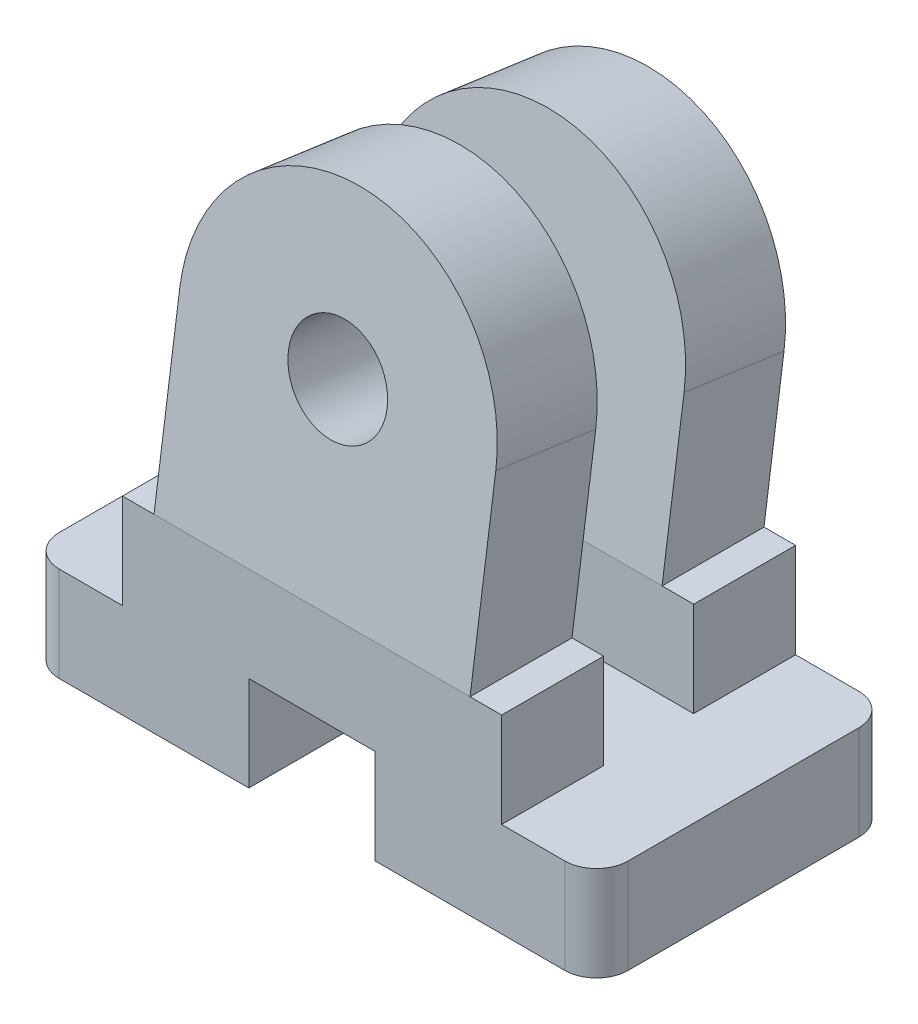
ISO-10303-21;
HEADER;
FILE_DESCRIPTION(('STEP AP214'),'2;1');
FILE_NAME('part.step','',(''),(''),'','','');
FILE_SCHEMA(('AUTOMOTIVE_DESIGN { 1 0 10303 214 1 1 1 1 }'));
ENDSEC;
DATA;
#1=APPLICATION_CONTEXT('core data for automotive mechanical design processes');
#2=APPLICATION_PROTOCOL_DEFINITION('international standard','automotive_design',2000,#1);
#3=PRODUCT_CONTEXT('',#1,'mechanical');
#4=PRODUCT('Part','Part','',(#3));
#5=PRODUCT_RELATED_PRODUCT_CATEGORY('part','',(#4));
#6=PRODUCT_DEFINITION_FORMATION('','',#4);
#7=PRODUCT_DEFINITION_CONTEXT('part definition',#1,'design');
#8=PRODUCT_DEFINITION('design','',#6,#7);
#9=PRODUCT_DEFINITION_SHAPE('','',#8);
#10=(LENGTH_UNIT() NAMED_UNIT(*) SI_UNIT(.MILLI.,.METRE.));
#11=(NAMED_UNIT(*) PLANE_ANGLE_UNIT() SI_UNIT($,.RADIAN.));
#12=(NAMED_UNIT(*) SI_UNIT($,.STERADIAN.) SOLID_ANGLE_UNIT());
#13=UNCERTAINTY_MEASURE_WITH_UNIT(LENGTH_MEASURE(1.E-05),#10,'distance_accuracy_value','');
#14=(GEOMETRIC_REPRESENTATION_CONTEXT(3) GLOBAL_UNCERTAINTY_ASSIGNED_CONTEXT((#13)) GLOBAL_UNIT_ASSIGNED_CONTEXT((#10,
#11,#12)) REPRESENTATION_CONTEXT('',''));
#15=CARTESIAN_POINT('',(0.,0.,0.));
#16=DIRECTION('',(0.,0.,1.));
#17=DIRECTION('',(1.,0.,0.));
#18=AXIS2_PLACEMENT_3D('',#15,#16,#17);
#19=CARTESIAN_POINT('',(0.,3.,0.));
#20=DIRECTION('',(0.,1.,0.));
#21=DIRECTION('',(0.,0.,1.));
#22=AXIS2_PLACEMENT_3D('',#19,#20,#21);
#23=PLANE('',#22);
#24=DIRECTION('',(0.,0.,-1.));
#25=VECTOR('',#24,1.);
#26=CARTESIAN_POINT('',(9.,3.,-4.65));
#27=LINE('',#26,#25);
#28=CARTESIAN_POINT('',(9.,3.,3.65));
#29=VERTEX_POINT('',#28);
#30=CARTESIAN_POINT('',(9.,3.,-3.65));
#31=VERTEX_POINT('',#30);
#32=EDGE_CURVE('E461',#29,#31,#27,.T.);
#33=ORIENTED_EDGE('',*,*,#32,.T.);
#34=CARTESIAN_POINT('',(8.,3.,-3.65));
#35=DIRECTION('',(0.,1.,0.));
#36=DIRECTION('',(0.,0.,1.));
#37=AXIS2_PLACEMENT_3D('',#34,#35,#36);
#38=CIRCLE('',#37,1.);
#39=CARTESIAN_POINT('',(8.,3.,-4.65));
#40=VERTEX_POINT('',#39);
#41=EDGE_CURVE('E12',#31,#40,#38,.T.);
#42=ORIENTED_EDGE('',*,*,#41,.T.);
#43=DIRECTION('',(-1.,0.,0.));
#44=VECTOR('',#43,1.);
#45=CARTESIAN_POINT('',(-9.,3.,-4.65));
#46=LINE('',#45,#44);
#47=CARTESIAN_POINT('',(6.,3.,-4.65));
#48=VERTEX_POINT('',#47);
#49=EDGE_CURVE('E471',#40,#48,#46,.T.);
#50=ORIENTED_EDGE('',*,*,#49,.T.);
#51=DIRECTION('',(0.,0.,-1.));
#52=VECTOR('',#51,1.);
#53=CARTESIAN_POINT('',(6.,3.,-4.65));
#54=LINE('',#53,#52);
#55=CARTESIAN_POINT('',(6.,3.,-1.425));
#56=VERTEX_POINT('',#55);
#57=EDGE_CURVE('E435',#56,#48,#54,.T.);
#58=ORIENTED_EDGE('',*,*,#57,.F.);
#59=DIRECTION('',(1.,0.,0.));
#60=VECTOR('',#59,1.);
#61=CARTESIAN_POINT('',(-6.,3.,-1.425));
#62=LINE('',#61,#60);
#63=CARTESIAN_POINT('',(2.,3.,-1.425));
#64=VERTEX_POINT('',#63);
#65=EDGE_CURVE('E444',#64,#56,#62,.T.);
#66=ORIENTED_EDGE('',*,*,#65,.F.);
#67=DIRECTION('',(0.,0.,1.));
#68=VECTOR('',#67,1.);
#69=CARTESIAN_POINT('',(2.,3.,4.65));
#70=LINE('',#69,#68);
#71=CARTESIAN_POINT('',(2.,3.,1.425));
#72=VERTEX_POINT('',#71);
#73=EDGE_CURVE('E283',#64,#72,#70,.T.);
#74=ORIENTED_EDGE('',*,*,#73,.T.);
#75=DIRECTION('',(-1.,0.,0.));
#76=VECTOR('',#75,1.);
#77=CARTESIAN_POINT('',(-6.,3.,1.425));
#78=LINE('',#77,#76);
#79=CARTESIAN_POINT('',(6.,3.,1.425));
#80=VERTEX_POINT('',#79);
#81=EDGE_CURVE('E563',#80,#72,#78,.T.);
#82=ORIENTED_EDGE('',*,*,#81,.F.);
#83=DIRECTION('',(0.,0.,-1.));
#84=VECTOR('',#83,1.);
#85=CARTESIAN_POINT('',(6.,3.,4.65));
#86=LINE('',#85,#84);
#87=CARTESIAN_POINT('',(6.,3.,4.65));
#88=VERTEX_POINT('',#87);
#89=EDGE_CURVE('E568',#88,#80,#86,.T.);
#90=ORIENTED_EDGE('',*,*,#89,.F.);
#91=DIRECTION('',(1.,0.,0.));
#92=VECTOR('',#91,1.);
#93=CARTESIAN_POINT('',(-9.,3.,4.65));
#94=LINE('',#93,#92);
#95=CARTESIAN_POINT('',(8.,3.,4.65));
#96=VERTEX_POINT('',#95);
#97=EDGE_CURVE('E458',#88,#96,#94,.T.);
#98=ORIENTED_EDGE('',*,*,#97,.T.);
#99=CARTESIAN_POINT('',(8.,3.,3.65));
#100=DIRECTION('',(0.,1.,0.));
#101=DIRECTION('',(0.,0.,1.));
#102=AXIS2_PLACEMENT_3D('',#99,#100,#101);
#103=CIRCLE('',#102,1.);
#104=EDGE_CURVE('E86',#96,#29,#103,.T.);
#105=ORIENTED_EDGE('',*,*,#104,.T.);
#106=EDGE_LOOP('',(#33,#42,#50,#58,#66,#74,#82,#90,#98,#105));
#107=FACE_BOUND('',#106,.T.);
#108=ADVANCED_FACE('F78',(#107),#23,.T.);
#109=CARTESIAN_POINT('',(0.,0.,0.));
#110=DIRECTION('',(0.,1.,0.));
#111=DIRECTION('',(0.,0.,1.));
#112=AXIS2_PLACEMENT_3D('',#109,#110,#111);
#113=PLANE('',#112);
#114=DIRECTION('',(-1.,0.,0.));
#115=VECTOR('',#114,1.);
#116=CARTESIAN_POINT('',(-9.,0.,-4.65));
#117=LINE('',#116,#115);
#118=CARTESIAN_POINT('',(8.,0.,-4.65));
#119=VERTEX_POINT('',#118);
#120=CARTESIAN_POINT('',(2.,0.,-4.65));
#121=VERTEX_POINT('',#120);
#122=EDGE_CURVE('E303',#119,#121,#117,.T.);
#123=ORIENTED_EDGE('',*,*,#122,.F.);
#124=CARTESIAN_POINT('',(8.,0.,-3.65));
#125=DIRECTION('',(0.,1.,0.));
#126=DIRECTION('',(0.,0.,1.));
#127=AXIS2_PLACEMENT_3D('',#124,#125,#126);
#128=CIRCLE('',#127,1.);
#129=CARTESIAN_POINT('',(9.,0.,-3.65));
#130=VERTEX_POINT('',#129);
#131=EDGE_CURVE('E491',#119,#130,#128,.F.);
#132=ORIENTED_EDGE('',*,*,#131,.T.);
#133=DIRECTION('',(0.,0.,-1.));
#134=VECTOR('',#133,1.);
#135=CARTESIAN_POINT('',(9.,0.,-4.65));
#136=LINE('',#135,#134);
#137=CARTESIAN_POINT('',(9.,0.,3.65));
#138=VERTEX_POINT('',#137);
#139=EDGE_CURVE('E499',#138,#130,#136,.T.);
#140=ORIENTED_EDGE('',*,*,#139,.F.);
#141=CARTESIAN_POINT('',(8.,0.,3.65));
#142=DIRECTION('',(0.,1.,0.));
#143=DIRECTION('',(0.,0.,1.));
#144=AXIS2_PLACEMENT_3D('',#141,#142,#143);
#145=CIRCLE('',#144,1.);
#146=CARTESIAN_POINT('',(8.,0.,4.65));
#147=VERTEX_POINT('',#146);
#148=EDGE_CURVE('E489',#138,#147,#145,.F.);
#149=ORIENTED_EDGE('',*,*,#148,.T.);
#150=DIRECTION('',(1.,0.,0.));
#151=VECTOR('',#150,1.);
#152=CARTESIAN_POINT('',(-9.,0.,4.65));
#153=LINE('',#152,#151);
#154=CARTESIAN_POINT('',(2.,0.,4.65));
#155=VERTEX_POINT('',#154);
#156=EDGE_CURVE('E508',#155,#147,#153,.T.);
#157=ORIENTED_EDGE('',*,*,#156,.F.);
#158=DIRECTION('',(0.,0.,1.));
#159=VECTOR('',#158,1.);
#160=CARTESIAN_POINT('',(2.,0.,4.65));
#161=LINE('',#160,#159);
#162=EDGE_CURVE('E297',#121,#155,#161,.T.);
#163=ORIENTED_EDGE('',*,*,#162,.F.);
#164=EDGE_LOOP('',(#123,#132,#140,#149,#157,#163));
#165=FACE_BOUND('',#164,.T.);
#166=ADVANCED_FACE('F502',(#165),#113,.F.);
#167=CARTESIAN_POINT('',(-5.,0.757071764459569,5.38684551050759));
#168=DIRECTION('',(0.,-0.139173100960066,-0.99026806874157));
#169=DIRECTION('',(0.,0.99026806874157,-0.139173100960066));
#170=AXIS2_PLACEMENT_3D('',#167,#168,#169);
#171=PLANE('',#170);
#172=CARTESIAN_POINT('',(0.,11.788588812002,3.83646689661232));
#173=DIRECTION('',(0.,0.139173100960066,0.99026806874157));
#174=DIRECTION('',(0.,-0.99026806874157,0.139173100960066));
#175=AXIS2_PLACEMENT_3D('',#172,#173,#174);
#176=CIRCLE('',#175,1.5625);
#177=CARTESIAN_POINT('',(0.,10.2412949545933,4.05392486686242));
#178=VERTEX_POINT('',#177);
#179=EDGE_CURVE('E328',#178,#178,#176,.T.);
#180=ORIENTED_EDGE('',*,*,#179,.F.);
#181=EDGE_LOOP('',(#180));
#182=FACE_BOUND('',#181,.T.);
#183=DIRECTION('',(0.,0.99026806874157,-0.139173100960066));
#184=VECTOR('',#183,1.);
#185=CARTESIAN_POINT('',(5.,0.757071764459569,5.38684551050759));
#186=LINE('',#185,#184);
#187=CARTESIAN_POINT('',(5.,6.,4.65));
#188=VERTEX_POINT('',#187);
#189=CARTESIAN_POINT('',(5.,11.788588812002,3.83646689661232));
#190=VERTEX_POINT('',#189);
#191=EDGE_CURVE('E373',#188,#190,#186,.T.);
#192=ORIENTED_EDGE('',*,*,#191,.T.);
#193=CARTESIAN_POINT('',(0.,11.788588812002,3.83646689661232));
#194=DIRECTION('',(0.,0.139173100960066,0.99026806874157));
#195=DIRECTION('',(0.,-0.99026806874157,0.139173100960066));
#196=AXIS2_PLACEMENT_3D('',#193,#194,#195);
#197=CIRCLE('',#196,5.);
#198=CARTESIAN_POINT('',(-5.,11.788588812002,3.83646689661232));
#199=VERTEX_POINT('',#198);
#200=EDGE_CURVE('E317',#190,#199,#197,.T.);
#201=ORIENTED_EDGE('',*,*,#200,.T.);
#202=DIRECTION('',(0.,0.99026806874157,-0.139173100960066));
#203=VECTOR('',#202,1.);
#204=CARTESIAN_POINT('',(-5.,0.757071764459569,5.38684551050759));
#205=LINE('',#204,#203);
#206=CARTESIAN_POINT('',(-5.,6.,4.65));
#207=VERTEX_POINT('',#206);
#208=EDGE_CURVE('E603',#207,#199,#205,.T.);
#209=ORIENTED_EDGE('',*,*,#208,.F.);
#210=DIRECTION('',(1.,0.,0.));
#211=VECTOR('',#210,1.);
#212=CARTESIAN_POINT('',(-5.,6.,4.65));
#213=LINE('',#212,#211);
#214=EDGE_CURVE('E570',#207,#188,#213,.T.);
#215=ORIENTED_EDGE('',*,*,#214,.T.);
#216=EDGE_LOOP('',(#192,#201,#209,#215));
#217=FACE_BOUND('',#216,.T.);
#218=ADVANCED_FACE('F678',(#182,#217),#171,.F.);
#219=CARTESIAN_POINT('',(-5.,0.312606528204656,2.22431102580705));
#220=DIRECTION('',(0.,0.139173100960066,0.99026806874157));
#221=DIRECTION('',(0.,-0.99026806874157,0.139173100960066));
#222=AXIS2_PLACEMENT_3D('',#219,#220,#221);
#223=PLANE('',#222);
#224=CARTESIAN_POINT('',(0.,11.3441235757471,0.673932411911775));
#225=DIRECTION('',(0.,0.139173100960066,0.99026806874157));
#226=DIRECTION('',(0.,-0.99026806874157,0.139173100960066));
#227=AXIS2_PLACEMENT_3D('',#224,#225,#226);
#228=CIRCLE('',#227,1.5625);
#229=CARTESIAN_POINT('',(0.,9.79682971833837,0.891390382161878));
#230=VERTEX_POINT('',#229);
#231=EDGE_CURVE('E335',#230,#230,#228,.T.);
#232=ORIENTED_EDGE('',*,*,#231,.T.);
#233=EDGE_LOOP('',(#232));
#234=FACE_BOUND('',#233,.T.);
#235=CARTESIAN_POINT('',(0.,11.3441235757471,0.673932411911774));
#236=DIRECTION('',(0.,0.139173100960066,0.99026806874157));
#237=DIRECTION('',(0.,-0.99026806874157,0.139173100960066));
#238=AXIS2_PLACEMENT_3D('',#235,#236,#237);
#239=CIRCLE('',#238,5.);
#240=CARTESIAN_POINT('',(5.,11.3441235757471,0.673932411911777));
#241=VERTEX_POINT('',#240);
#242=CARTESIAN_POINT('',(-5.,11.3441235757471,0.673932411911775));
#243=VERTEX_POINT('',#242);
#244=EDGE_CURVE('E326',#241,#243,#239,.T.);
#245=ORIENTED_EDGE('',*,*,#244,.F.);
#246=DIRECTION('',(0.,-0.99026806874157,0.139173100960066));
#247=VECTOR('',#246,1.);
#248=CARTESIAN_POINT('',(5.,0.312606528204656,2.22431102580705));
#249=LINE('',#248,#247);
#250=CARTESIAN_POINT('',(5.,6.,1.425));
#251=VERTEX_POINT('',#250);
#252=EDGE_CURVE('E370',#241,#251,#249,.T.);
#253=ORIENTED_EDGE('',*,*,#252,.T.);
#254=DIRECTION('',(1.,0.,0.));
#255=VECTOR('',#254,1.);
#256=CARTESIAN_POINT('',(-5.,6.,1.425));
#257=LINE('',#256,#255);
#258=CARTESIAN_POINT('',(-5.,6.,1.425));
#259=VERTEX_POINT('',#258);
#260=EDGE_CURVE('E598',#259,#251,#257,.T.);
#261=ORIENTED_EDGE('',*,*,#260,.F.);
#262=DIRECTION('',(0.,-0.99026806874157,0.139173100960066));
#263=VECTOR('',#262,1.);
#264=CARTESIAN_POINT('',(-5.,0.312606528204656,2.22431102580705));
#265=LINE('',#264,#263);
#266=EDGE_CURVE('E362',#243,#259,#265,.T.);
#267=ORIENTED_EDGE('',*,*,#266,.F.);
#268=EDGE_LOOP('',(#245,#253,#261,#267));
#269=FACE_BOUND('',#268,.T.);
#270=ADVANCED_FACE('F624',(#234,#269),#223,.F.);
#271=CARTESIAN_POINT('',(-5.,-0.0801767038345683,-0.570486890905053));
#272=DIRECTION('',(0.,-0.139173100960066,-0.99026806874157));
#273=DIRECTION('',(0.,0.99026806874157,-0.139173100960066));
#274=AXIS2_PLACEMENT_3D('',#271,#272,#273);
#275=PLANE('',#274);
#276=CARTESIAN_POINT('',(0.,10.9513403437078,-2.12086550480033));
#277=DIRECTION('',(0.,-0.139173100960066,-0.99026806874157));
#278=DIRECTION('',(0.,0.99026806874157,-0.139173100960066));
#279=AXIS2_PLACEMENT_3D('',#276,#277,#278);
#280=CIRCLE('',#279,1.5625);
#281=CARTESIAN_POINT('',(0.,12.4986342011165,-2.33832347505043));
#282=VERTEX_POINT('',#281);
#283=EDGE_CURVE('E332',#282,#282,#280,.T.);
#284=ORIENTED_EDGE('',*,*,#283,.T.);
#285=EDGE_LOOP('',(#284));
#286=FACE_BOUND('',#285,.T.);
#287=DIRECTION('',(0.,0.99026806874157,-0.139173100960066));
#288=VECTOR('',#287,1.);
#289=CARTESIAN_POINT('',(5.,-0.0801767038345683,-0.570486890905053));
#290=LINE('',#289,#288);
#291=CARTESIAN_POINT('',(5.,6.,-1.425));
#292=VERTEX_POINT('',#291);
#293=CARTESIAN_POINT('',(5.,10.9513403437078,-2.12086550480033));
#294=VERTEX_POINT('',#293);
#295=EDGE_CURVE('E338',#292,#294,#290,.T.);
#296=ORIENTED_EDGE('',*,*,#295,.T.);
#297=CARTESIAN_POINT('',(0.,10.9513403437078,-2.12086550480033));
#298=DIRECTION('',(0.,-0.139173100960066,-0.99026806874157));
#299=DIRECTION('',(0.,0.99026806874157,-0.139173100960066));
#300=AXIS2_PLACEMENT_3D('',#297,#298,#299);
#301=CIRCLE('',#300,5.);
#302=CARTESIAN_POINT('',(-5.,10.9513403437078,-2.12086550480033));
#303=VERTEX_POINT('',#302);
#304=EDGE_CURVE('E324',#303,#294,#301,.T.);
#305=ORIENTED_EDGE('',*,*,#304,.F.);
#306=DIRECTION('',(0.,0.99026806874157,-0.139173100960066));
#307=VECTOR('',#306,1.);
#308=CARTESIAN_POINT('',(-5.,-0.0801767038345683,-0.570486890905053));
#309=LINE('',#308,#307);
#310=CARTESIAN_POINT('',(-5.,6.,-1.425));
#311=VERTEX_POINT('',#310);
#312=EDGE_CURVE('E361',#311,#303,#309,.T.);
#313=ORIENTED_EDGE('',*,*,#312,.F.);
#314=DIRECTION('',(1.,0.,0.));
#315=VECTOR('',#314,1.);
#316=CARTESIAN_POINT('',(-5.,6.,-1.425));
#317=LINE('',#316,#315);
#318=EDGE_CURVE('E634',#311,#292,#317,.T.);
#319=ORIENTED_EDGE('',*,*,#318,.T.);
#320=EDGE_LOOP('',(#296,#305,#313,#319));
#321=FACE_BOUND('',#320,.T.);
#322=ADVANCED_FACE('F653',(#286,#321),#275,.F.);
#323=CARTESIAN_POINT('',(-5.,-0.524641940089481,-3.73302137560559));
#324=DIRECTION('',(0.,0.139173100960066,0.99026806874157));
#325=DIRECTION('',(0.,-0.99026806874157,0.139173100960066));
#326=AXIS2_PLACEMENT_3D('',#323,#324,#325);
#327=PLANE('',#326);
#328=CARTESIAN_POINT('',(0.,10.5068751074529,-5.28339998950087));
#329=DIRECTION('',(0.,0.139173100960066,0.99026806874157));
#330=DIRECTION('',(0.,-0.99026806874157,0.139173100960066));
#331=AXIS2_PLACEMENT_3D('',#328,#329,#330);
#332=CIRCLE('',#331,1.5625);
#333=CARTESIAN_POINT('',(0.,8.95958125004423,-5.06594201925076));
#334=VERTEX_POINT('',#333);
#335=EDGE_CURVE('E331',#334,#334,#332,.T.);
#336=ORIENTED_EDGE('',*,*,#335,.T.);
#337=EDGE_LOOP('',(#336));
#338=FACE_BOUND('',#337,.T.);
#339=CARTESIAN_POINT('',(0.,10.5068751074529,-5.28339998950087));
#340=DIRECTION('',(0.,0.139173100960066,0.99026806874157));
#341=DIRECTION('',(0.,-0.99026806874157,0.139173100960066));
#342=AXIS2_PLACEMENT_3D('',#339,#340,#341);
#343=CIRCLE('',#342,5.);
#344=CARTESIAN_POINT('',(5.,10.5068751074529,-5.28339998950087));
#345=VERTEX_POINT('',#344);
#346=CARTESIAN_POINT('',(-5.,10.5068751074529,-5.28339998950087));
#347=VERTEX_POINT('',#346);
#348=EDGE_CURVE('E322',#345,#347,#343,.T.);
#349=ORIENTED_EDGE('',*,*,#348,.F.);
#350=DIRECTION('',(0.,-0.99026806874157,0.139173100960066));
#351=VECTOR('',#350,1.);
#352=CARTESIAN_POINT('',(5.,-0.524641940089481,-3.73302137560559));
#353=LINE('',#352,#351);
#354=CARTESIAN_POINT('',(5.,6.,-4.65));
#355=VERTEX_POINT('',#354);
#356=EDGE_CURVE('E348',#345,#355,#353,.T.);
#357=ORIENTED_EDGE('',*,*,#356,.T.);
#358=DIRECTION('',(1.,0.,0.));
#359=VECTOR('',#358,1.);
#360=CARTESIAN_POINT('',(-5.,6.,-4.65));
#361=LINE('',#360,#359);
#362=CARTESIAN_POINT('',(-5.,6.,-4.65));
#363=VERTEX_POINT('',#362);
#364=EDGE_CURVE('E633',#363,#355,#361,.T.);
#365=ORIENTED_EDGE('',*,*,#364,.F.);
#366=DIRECTION('',(0.,-0.99026806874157,0.139173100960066));
#367=VECTOR('',#366,1.);
#368=CARTESIAN_POINT('',(-5.,-0.524641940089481,-3.73302137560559));
#369=LINE('',#368,#367);
#370=EDGE_CURVE('E637',#347,#363,#369,.T.);
#371=ORIENTED_EDGE('',*,*,#370,.F.);
#372=EDGE_LOOP('',(#349,#357,#365,#371));
#373=FACE_BOUND('',#372,.T.);
#374=ADVANCED_FACE('F766',(#338,#373),#327,.F.);
#375=CARTESIAN_POINT('',(5.,0.,0.));
#376=DIRECTION('',(1.,0.,0.));
#377=DIRECTION('',(0.,0.,-1.));
#378=AXIS2_PLACEMENT_3D('',#375,#376,#377);
#379=PLANE('',#378);
#380=ORIENTED_EDGE('',*,*,#252,.F.);
#381=DIRECTION('',(0.,0.139173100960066,0.99026806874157));
#382=VECTOR('',#381,1.);
#383=CARTESIAN_POINT('',(5.,10.207459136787,-7.41385532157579));
#384=LINE('',#383,#382);
#385=EDGE_CURVE('E314',#241,#190,#384,.T.);
#386=ORIENTED_EDGE('',*,*,#385,.T.);
#387=ORIENTED_EDGE('',*,*,#191,.F.);
#388=DIRECTION('',(0.,0.,1.));
#389=VECTOR('',#388,1.);
#390=CARTESIAN_POINT('',(5.,6.,0.));
#391=LINE('',#390,#389);
#392=EDGE_CURVE('E374',#251,#188,#391,.T.);
#393=ORIENTED_EDGE('',*,*,#392,.F.);
#394=EDGE_LOOP('',(#380,#386,#387,#393));
#395=FACE_BOUND('',#394,.T.);
#396=ADVANCED_FACE('F629',(#395),#379,.T.);
#397=CARTESIAN_POINT('',(5.,0.,0.));
#398=DIRECTION('',(1.,0.,0.));
#399=DIRECTION('',(0.,0.,-1.));
#400=AXIS2_PLACEMENT_3D('',#397,#398,#399);
#401=PLANE('',#400);
#402=ORIENTED_EDGE('',*,*,#356,.F.);
#403=DIRECTION('',(0.,0.139173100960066,0.99026806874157));
#404=VECTOR('',#403,1.);
#405=CARTESIAN_POINT('',(5.,10.207459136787,-7.41385532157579));
#406=LINE('',#405,#404);
#407=EDGE_CURVE('E365',#345,#294,#406,.T.);
#408=ORIENTED_EDGE('',*,*,#407,.T.);
#409=ORIENTED_EDGE('',*,*,#295,.F.);
#410=DIRECTION('',(0.,0.,-1.));
#411=VECTOR('',#410,1.);
#412=CARTESIAN_POINT('',(5.,6.,0.));
#413=LINE('',#412,#411);
#414=EDGE_CURVE('E344',#292,#355,#413,.T.);
#415=ORIENTED_EDGE('',*,*,#414,.T.);
#416=EDGE_LOOP('',(#402,#408,#409,#415));
#417=FACE_BOUND('',#416,.T.);
#418=ADVANCED_FACE('F664',(#417),#401,.T.);
#419=CARTESIAN_POINT('',(-5.,0.,0.));
#420=DIRECTION('',(1.,0.,0.));
#421=DIRECTION('',(0.,0.,-1.));
#422=AXIS2_PLACEMENT_3D('',#419,#420,#421);
#423=PLANE('',#422);
#424=DIRECTION('',(0.,0.139173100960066,0.99026806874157));
#425=VECTOR('',#424,1.);
#426=CARTESIAN_POINT('',(-5.,10.207459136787,-7.41385532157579));
#427=LINE('',#426,#425);
#428=EDGE_CURVE('E320',#243,#199,#427,.T.);
#429=ORIENTED_EDGE('',*,*,#428,.F.);
#430=ORIENTED_EDGE('',*,*,#266,.T.);
#431=DIRECTION('',(0.,0.,1.));
#432=VECTOR('',#431,1.);
#433=CARTESIAN_POINT('',(-5.,6.,0.));
#434=LINE('',#433,#432);
#435=EDGE_CURVE('E382',#259,#207,#434,.T.);
#436=ORIENTED_EDGE('',*,*,#435,.T.);
#437=ORIENTED_EDGE('',*,*,#208,.T.);
#438=EDGE_LOOP('',(#429,#430,#436,#437));
#439=FACE_BOUND('',#438,.T.);
#440=ADVANCED_FACE('F615',(#439),#423,.F.);
#441=CARTESIAN_POINT('',(-5.,0.,0.));
#442=DIRECTION('',(1.,0.,0.));
#443=DIRECTION('',(0.,0.,-1.));
#444=AXIS2_PLACEMENT_3D('',#441,#442,#443);
#445=PLANE('',#444);
#446=DIRECTION('',(0.,0.139173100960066,0.99026806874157));
#447=VECTOR('',#446,1.);
#448=CARTESIAN_POINT('',(-5.,10.207459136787,-7.41385532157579));
#449=LINE('',#448,#447);
#450=EDGE_CURVE('E369',#347,#303,#449,.T.);
#451=ORIENTED_EDGE('',*,*,#450,.F.);
#452=ORIENTED_EDGE('',*,*,#370,.T.);
#453=DIRECTION('',(0.,0.,-1.));
#454=VECTOR('',#453,1.);
#455=CARTESIAN_POINT('',(-5.,6.,0.));
#456=LINE('',#455,#454);
#457=EDGE_CURVE('E425',#311,#363,#456,.T.);
#458=ORIENTED_EDGE('',*,*,#457,.F.);
#459=ORIENTED_EDGE('',*,*,#312,.T.);
#460=EDGE_LOOP('',(#451,#452,#458,#459));
#461=FACE_BOUND('',#460,.T.);
#462=ADVANCED_FACE('F655',(#461),#445,.F.);
#463=CARTESIAN_POINT('',(0.,6.,0.));
#464=DIRECTION('',(0.,1.,0.));
#465=DIRECTION('',(0.,0.,1.));
#466=AXIS2_PLACEMENT_3D('',#463,#464,#465);
#467=PLANE('',#466);
#468=DIRECTION('',(1.,0.,0.));
#469=VECTOR('',#468,1.);
#470=CARTESIAN_POINT('',(-6.,6.,-1.425));
#471=LINE('',#470,#469);
#472=CARTESIAN_POINT('',(-6.,6.,-1.425));
#473=VERTEX_POINT('',#472);
#474=EDGE_CURVE('E385',#473,#311,#471,.T.);
#475=ORIENTED_EDGE('',*,*,#474,.T.);
#476=ORIENTED_EDGE('',*,*,#457,.T.);
#477=DIRECTION('',(-1.,0.,0.));
#478=VECTOR('',#477,1.);
#479=CARTESIAN_POINT('',(-6.,6.,-4.65));
#480=LINE('',#479,#478);
#481=CARTESIAN_POINT('',(-6.,6.,-4.65));
#482=VERTEX_POINT('',#481);
#483=EDGE_CURVE('E399',#363,#482,#480,.T.);
#484=ORIENTED_EDGE('',*,*,#483,.T.);
#485=DIRECTION('',(0.,0.,1.));
#486=VECTOR('',#485,1.);
#487=CARTESIAN_POINT('',(-6.,6.,-4.65));
#488=LINE('',#487,#486);
#489=EDGE_CURVE('E395',#482,#473,#488,.T.);
#490=ORIENTED_EDGE('',*,*,#489,.T.);
#491=EDGE_LOOP('',(#475,#476,#484,#490));
#492=FACE_BOUND('',#491,.T.);
#493=ADVANCED_FACE('F421',(#492),#467,.T.);
#494=CARTESIAN_POINT('',(0.,6.,0.));
#495=DIRECTION('',(0.,1.,0.));
#496=DIRECTION('',(0.,0.,1.));
#497=AXIS2_PLACEMENT_3D('',#494,#495,#496);
#498=PLANE('',#497);
#499=DIRECTION('',(-1.,0.,0.));
#500=VECTOR('',#499,1.);
#501=CARTESIAN_POINT('',(-6.,6.,1.425));
#502=LINE('',#501,#500);
#503=CARTESIAN_POINT('',(6.,6.,1.425));
#504=VERTEX_POINT('',#503);
#505=EDGE_CURVE('E572',#504,#251,#502,.T.);
#506=ORIENTED_EDGE('',*,*,#505,.T.);
#507=ORIENTED_EDGE('',*,*,#392,.T.);
#508=DIRECTION('',(1.,0.,0.));
#509=VECTOR('',#508,1.);
#510=CARTESIAN_POINT('',(-6.,6.,4.65));
#511=LINE('',#510,#509);
#512=CARTESIAN_POINT('',(6.,6.,4.65));
#513=VERTEX_POINT('',#512);
#514=EDGE_CURVE('E562',#188,#513,#511,.T.);
#515=ORIENTED_EDGE('',*,*,#514,.T.);
#516=DIRECTION('',(0.,0.,-1.));
#517=VECTOR('',#516,1.);
#518=CARTESIAN_POINT('',(6.,6.,4.65));
#519=LINE('',#518,#517);
#520=EDGE_CURVE('E575',#513,#504,#519,.T.);
#521=ORIENTED_EDGE('',*,*,#520,.T.);
#522=EDGE_LOOP('',(#506,#507,#515,#521));
#523=FACE_BOUND('',#522,.T.);
#524=ADVANCED_FACE('F682',(#523),#498,.T.);
#525=CARTESIAN_POINT('',(-6.,3.,-4.65));
#526=VERTEX_POINT('',#525);
#527=CARTESIAN_POINT('',(-8.,3.,-4.65));
#528=VERTEX_POINT('',#527);
#529=EDGE_CURVE('E429',#526,#528,#46,.T.);
#530=ORIENTED_EDGE('',*,*,#529,.T.);
#531=CARTESIAN_POINT('',(-8.,3.,-3.65));
#532=DIRECTION('',(0.,1.,0.));
#533=DIRECTION('',(0.,0.,1.));
#534=AXIS2_PLACEMENT_3D('',#531,#532,#533);
#535=CIRCLE('',#534,1.);
#536=CARTESIAN_POINT('',(-9.,3.,-3.65));
#537=VERTEX_POINT('',#536);
#538=EDGE_CURVE('E482',#528,#537,#535,.T.);
#539=ORIENTED_EDGE('',*,*,#538,.T.);
#540=DIRECTION('',(0.,0.,1.));
#541=VECTOR('',#540,1.);
#542=CARTESIAN_POINT('',(-9.,3.,-4.65));
#543=LINE('',#542,#541);
#544=CARTESIAN_POINT('',(-9.,3.,3.65));
#545=VERTEX_POINT('',#544);
#546=EDGE_CURVE('E455',#537,#545,#543,.T.);
#547=ORIENTED_EDGE('',*,*,#546,.T.);
#548=CARTESIAN_POINT('',(-8.,3.,3.65));
#549=DIRECTION('',(0.,1.,0.));
#550=DIRECTION('',(0.,0.,1.));
#551=AXIS2_PLACEMENT_3D('',#548,#549,#550);
#552=CIRCLE('',#551,1.);
#553=CARTESIAN_POINT('',(-8.,3.,4.65));
#554=VERTEX_POINT('',#553);
#555=EDGE_CURVE('E480',#545,#554,#552,.T.);
#556=ORIENTED_EDGE('',*,*,#555,.T.);
#557=CARTESIAN_POINT('',(-6.,3.,4.65));
#558=VERTEX_POINT('',#557);
#559=EDGE_CURVE('E459',#554,#558,#94,.T.);
#560=ORIENTED_EDGE('',*,*,#559,.T.);
#561=DIRECTION('',(0.,0.,1.));
#562=VECTOR('',#561,1.);
#563=CARTESIAN_POINT('',(-6.,3.,4.65));
#564=LINE('',#563,#562);
#565=CARTESIAN_POINT('',(-6.,3.,1.425));
#566=VERTEX_POINT('',#565);
#567=EDGE_CURVE('E559',#566,#558,#564,.T.);
#568=ORIENTED_EDGE('',*,*,#567,.F.);
#569=CARTESIAN_POINT('',(-2.,3.,1.425));
#570=VERTEX_POINT('',#569);
#571=EDGE_CURVE('E567',#570,#566,#78,.T.);
#572=ORIENTED_EDGE('',*,*,#571,.F.);
#573=DIRECTION('',(0.,0.,-1.));
#574=VECTOR('',#573,1.);
#575=CARTESIAN_POINT('',(-2.,3.,4.65));
#576=LINE('',#575,#574);
#577=CARTESIAN_POINT('',(-2.,3.,-1.425));
#578=VERTEX_POINT('',#577);
#579=EDGE_CURVE('E1003',#570,#578,#576,.T.);
#580=ORIENTED_EDGE('',*,*,#579,.T.);
#581=CARTESIAN_POINT('',(-6.,3.,-1.425));
#582=VERTEX_POINT('',#581);
#583=EDGE_CURVE('E402',#582,#578,#62,.T.);
#584=ORIENTED_EDGE('',*,*,#583,.F.);
#585=DIRECTION('',(0.,0.,1.));
#586=VECTOR('',#585,1.);
#587=CARTESIAN_POINT('',(-6.,3.,-4.65));
#588=LINE('',#587,#586);
#589=EDGE_CURVE('E539',#526,#582,#588,.T.);
#590=ORIENTED_EDGE('',*,*,#589,.F.);
#591=EDGE_LOOP('',(#530,#539,#547,#556,#560,#568,#572,#580,#584,#590));
#592=FACE_BOUND('',#591,.T.);
#593=ADVANCED_FACE('F538',(#592),#23,.T.);
#594=CARTESIAN_POINT('',(-9.,3.,-4.65));
#595=DIRECTION('',(1.,0.,0.));
#596=DIRECTION('',(0.,0.,-1.));
#597=AXIS2_PLACEMENT_3D('',#594,#595,#596);
#598=PLANE('',#597);
#599=ORIENTED_EDGE('',*,*,#546,.F.);
#600=DIRECTION('',(0.,-1.,0.));
#601=VECTOR('',#600,1.);
#602=CARTESIAN_POINT('',(-9.,3.,-3.65));
#603=LINE('',#602,#601);
#604=CARTESIAN_POINT('',(-9.,0.,-3.65));
#605=VERTEX_POINT('',#604);
#606=EDGE_CURVE('E523',#537,#605,#603,.T.);
#607=ORIENTED_EDGE('',*,*,#606,.T.);
#608=DIRECTION('',(0.,0.,1.));
#609=VECTOR('',#608,1.);
#610=CARTESIAN_POINT('',(-9.,0.,-4.65));
#611=LINE('',#610,#609);
#612=CARTESIAN_POINT('',(-9.,0.,3.65));
#613=VERTEX_POINT('',#612);
#614=EDGE_CURVE('E454',#605,#613,#611,.T.);
#615=ORIENTED_EDGE('',*,*,#614,.T.);
#616=DIRECTION('',(0.,-1.,0.));
#617=VECTOR('',#616,1.);
#618=CARTESIAN_POINT('',(-9.,3.,3.65));
#619=LINE('',#618,#617);
#620=EDGE_CURVE('E368',#613,#545,#619,.F.);
#621=ORIENTED_EDGE('',*,*,#620,.T.);
#622=EDGE_LOOP('',(#599,#607,#615,#621));
#623=FACE_BOUND('',#622,.T.);
#624=ADVANCED_FACE('F521',(#623),#598,.F.);
#625=CARTESIAN_POINT('',(-9.,3.,4.65));
#626=DIRECTION('',(0.,0.,-1.));
#627=DIRECTION('',(-1.,0.,0.));
#628=AXIS2_PLACEMENT_3D('',#625,#626,#627);
#629=PLANE('',#628);
#630=ORIENTED_EDGE('',*,*,#559,.F.);
#631=DIRECTION('',(0.,-1.,0.));
#632=VECTOR('',#631,1.);
#633=CARTESIAN_POINT('',(-8.,3.,4.65));
#634=LINE('',#633,#632);
#635=CARTESIAN_POINT('',(-8.,0.,4.65));
#636=VERTEX_POINT('',#635);
#637=EDGE_CURVE('E486',#554,#636,#634,.T.);
#638=ORIENTED_EDGE('',*,*,#637,.T.);
#639=CARTESIAN_POINT('',(-2.,0.,4.65));
#640=VERTEX_POINT('',#639);
#641=EDGE_CURVE('E506',#636,#640,#153,.T.);
#642=ORIENTED_EDGE('',*,*,#641,.T.);
#643=DIRECTION('',(0.,-1.,0.));
#644=VECTOR('',#643,1.);
#645=CARTESIAN_POINT('',(-2.,13.1237344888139,4.65));
#646=LINE('',#645,#644);
#647=CARTESIAN_POINT('',(-2.,3.,4.65));
#648=VERTEX_POINT('',#647);
#649=EDGE_CURVE('E993',#648,#640,#646,.T.);
#650=ORIENTED_EDGE('',*,*,#649,.F.);
#651=DIRECTION('',(-1.,0.,0.));
#652=VECTOR('',#651,1.);
#653=CARTESIAN_POINT('',(-2.,3.,4.65));
#654=LINE('',#653,#652);
#655=CARTESIAN_POINT('',(2.,3.,4.65));
#656=VERTEX_POINT('',#655);
#657=EDGE_CURVE('E998',#656,#648,#654,.T.);
#658=ORIENTED_EDGE('',*,*,#657,.F.);
#659=DIRECTION('',(0.,-1.,0.));
#660=VECTOR('',#659,1.);
#661=CARTESIAN_POINT('',(2.,13.1237344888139,4.65));
#662=LINE('',#661,#660);
#663=EDGE_CURVE('E286',#656,#155,#662,.T.);
#664=ORIENTED_EDGE('',*,*,#663,.T.);
#665=ORIENTED_EDGE('',*,*,#156,.T.);
#666=DIRECTION('',(0.,-1.,0.));
#667=VECTOR('',#666,1.);
#668=CARTESIAN_POINT('',(8.,3.,4.65));
#669=LINE('',#668,#667);
#670=EDGE_CURVE('E484',#147,#96,#669,.F.);
#671=ORIENTED_EDGE('',*,*,#670,.T.);
#672=ORIENTED_EDGE('',*,*,#97,.F.);
#673=DIRECTION('',(0.,-1.,0.));
#674=VECTOR('',#673,1.);
#675=CARTESIAN_POINT('',(6.,6.,4.65));
#676=LINE('',#675,#674);
#677=EDGE_CURVE('E541',#513,#88,#676,.T.);
#678=ORIENTED_EDGE('',*,*,#677,.F.);
#679=ORIENTED_EDGE('',*,*,#514,.F.);
#680=ORIENTED_EDGE('',*,*,#214,.F.);
#681=CARTESIAN_POINT('',(-6.,6.,4.65));
#682=VERTEX_POINT('',#681);
#683=EDGE_CURVE('E585',#682,#207,#511,.T.);
#684=ORIENTED_EDGE('',*,*,#683,.F.);
#685=DIRECTION('',(0.,-1.,0.));
#686=VECTOR('',#685,1.);
#687=CARTESIAN_POINT('',(-6.,6.,4.65));
#688=LINE('',#687,#686);
#689=EDGE_CURVE('E555',#682,#558,#688,.T.);
#690=ORIENTED_EDGE('',*,*,#689,.T.);
#691=EDGE_LOOP('',(#630,#638,#642,#650,#658,#664,#665,#671,#672,#678,#679,#680,#684,#690));
#692=FACE_BOUND('',#691,.T.);
#693=ADVANCED_FACE('F687',(#692),#629,.F.);
#694=CARTESIAN_POINT('',(9.,3.,-4.65));
#695=DIRECTION('',(-1.,0.,0.));
#696=DIRECTION('',(0.,0.,1.));
#697=AXIS2_PLACEMENT_3D('',#694,#695,#696);
#698=PLANE('',#697);
#699=ORIENTED_EDGE('',*,*,#139,.T.);
#700=DIRECTION('',(0.,-1.,0.));
#701=VECTOR('',#700,1.);
#702=CARTESIAN_POINT('',(9.,3.,-3.65));
#703=LINE('',#702,#701);
#704=EDGE_CURVE('E93',#130,#31,#703,.F.);
#705=ORIENTED_EDGE('',*,*,#704,.T.);
#706=ORIENTED_EDGE('',*,*,#32,.F.);
#707=DIRECTION('',(0.,-1.,0.));
#708=VECTOR('',#707,1.);
#709=CARTESIAN_POINT('',(9.,3.,3.65));
#710=LINE('',#709,#708);
#711=EDGE_CURVE('E493',#29,#138,#710,.T.);
#712=ORIENTED_EDGE('',*,*,#711,.T.);
#713=EDGE_LOOP('',(#699,#705,#706,#712));
#714=FACE_BOUND('',#713,.T.);
#715=ADVANCED_FACE('F498',(#714),#698,.F.);
#716=CARTESIAN_POINT('',(-9.,3.,-4.65));
#717=DIRECTION('',(0.,0.,1.));
#718=DIRECTION('',(1.,0.,0.));
#719=AXIS2_PLACEMENT_3D('',#716,#717,#718);
#720=PLANE('',#719);
#721=CARTESIAN_POINT('',(-2.,0.,-4.65));
#722=VERTEX_POINT('',#721);
#723=CARTESIAN_POINT('',(-8.,0.,-4.65));
#724=VERTEX_POINT('',#723);
#725=EDGE_CURVE('E505',#722,#724,#117,.T.);
#726=ORIENTED_EDGE('',*,*,#725,.T.);
#727=DIRECTION('',(0.,-1.,0.));
#728=VECTOR('',#727,1.);
#729=CARTESIAN_POINT('',(-8.,3.,-4.65));
#730=LINE('',#729,#728);
#731=EDGE_CURVE('E478',#724,#528,#730,.F.);
#732=ORIENTED_EDGE('',*,*,#731,.T.);
#733=ORIENTED_EDGE('',*,*,#529,.F.);
#734=DIRECTION('',(0.,-1.,0.));
#735=VECTOR('',#734,1.);
#736=CARTESIAN_POINT('',(-6.,6.,-4.65));
#737=LINE('',#736,#735);
#738=EDGE_CURVE('E409',#482,#526,#737,.T.);
#739=ORIENTED_EDGE('',*,*,#738,.F.);
#740=ORIENTED_EDGE('',*,*,#483,.F.);
#741=ORIENTED_EDGE('',*,*,#364,.T.);
#742=CARTESIAN_POINT('',(6.,6.,-4.65));
#743=VERTEX_POINT('',#742);
#744=EDGE_CURVE('E407',#743,#355,#480,.T.);
#745=ORIENTED_EDGE('',*,*,#744,.F.);
#746=DIRECTION('',(0.,-1.,0.));
#747=VECTOR('',#746,1.);
#748=CARTESIAN_POINT('',(6.,6.,-4.65));
#749=LINE('',#748,#747);
#750=EDGE_CURVE('E414',#743,#48,#749,.T.);
#751=ORIENTED_EDGE('',*,*,#750,.T.);
#752=ORIENTED_EDGE('',*,*,#49,.F.);
#753=DIRECTION('',(0.,-1.,0.));
#754=VECTOR('',#753,1.);
#755=CARTESIAN_POINT('',(8.,3.,-4.65));
#756=LINE('',#755,#754);
#757=EDGE_CURVE('E476',#40,#119,#756,.T.);
#758=ORIENTED_EDGE('',*,*,#757,.T.);
#759=ORIENTED_EDGE('',*,*,#122,.T.);
#760=DIRECTION('',(0.,-1.,0.));
#761=VECTOR('',#760,1.);
#762=CARTESIAN_POINT('',(2.,13.1237344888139,-4.65));
#763=LINE('',#762,#761);
#764=CARTESIAN_POINT('',(2.,3.,-4.65));
#765=VERTEX_POINT('',#764);
#766=EDGE_CURVE('E279',#765,#121,#763,.T.);
#767=ORIENTED_EDGE('',*,*,#766,.F.);
#768=DIRECTION('',(1.,0.,0.));
#769=VECTOR('',#768,1.);
#770=CARTESIAN_POINT('',(-2.,3.,-4.65));
#771=LINE('',#770,#769);
#772=CARTESIAN_POINT('',(-2.,3.,-4.65));
#773=VERTEX_POINT('',#772);
#774=EDGE_CURVE('E290',#773,#765,#771,.T.);
#775=ORIENTED_EDGE('',*,*,#774,.F.);
#776=DIRECTION('',(0.,-1.,0.));
#777=VECTOR('',#776,1.);
#778=CARTESIAN_POINT('',(-2.,13.1237344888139,-4.65));
#779=LINE('',#778,#777);
#780=EDGE_CURVE('E308',#773,#722,#779,.T.);
#781=ORIENTED_EDGE('',*,*,#780,.T.);
#782=EDGE_LOOP('',(#726,#732,#733,#739,#740,#741,#745,#751,#752,#758,#759,#767,#775,#781));
#783=FACE_BOUND('',#782,.T.);
#784=ADVANCED_FACE('F300',(#783),#720,.F.);
#785=ORIENTED_EDGE('',*,*,#614,.F.);
#786=CARTESIAN_POINT('',(-8.,0.,-3.65));
#787=DIRECTION('',(0.,1.,0.));
#788=DIRECTION('',(0.,0.,1.));
#789=AXIS2_PLACEMENT_3D('',#786,#787,#788);
#790=CIRCLE('',#789,1.);
#791=EDGE_CURVE('E474',#605,#724,#790,.F.);
#792=ORIENTED_EDGE('',*,*,#791,.T.);
#793=ORIENTED_EDGE('',*,*,#725,.F.);
#794=DIRECTION('',(0.,0.,-1.));
#795=VECTOR('',#794,1.);
#796=CARTESIAN_POINT('',(-2.,0.,4.65));
#797=LINE('',#796,#795);
#798=EDGE_CURVE('E994',#640,#722,#797,.T.);
#799=ORIENTED_EDGE('',*,*,#798,.F.);
#800=ORIENTED_EDGE('',*,*,#641,.F.);
#801=CARTESIAN_POINT('',(-8.,0.,3.65));
#802=DIRECTION('',(0.,1.,0.));
#803=DIRECTION('',(0.,0.,1.));
#804=AXIS2_PLACEMENT_3D('',#801,#802,#803);
#805=CIRCLE('',#804,1.);
#806=EDGE_CURVE('E529',#636,#613,#805,.F.);
#807=ORIENTED_EDGE('',*,*,#806,.T.);
#808=EDGE_LOOP('',(#785,#792,#793,#799,#800,#807));
#809=FACE_BOUND('',#808,.T.);
#810=ADVANCED_FACE('F531',(#809),#113,.F.);
#811=CARTESIAN_POINT('',(-6.,6.,-4.65));
#812=DIRECTION('',(1.,0.,0.));
#813=DIRECTION('',(0.,0.,-1.));
#814=AXIS2_PLACEMENT_3D('',#811,#812,#813);
#815=PLANE('',#814);
#816=ORIENTED_EDGE('',*,*,#589,.T.);
#817=DIRECTION('',(0.,-1.,0.));
#818=VECTOR('',#817,1.);
#819=CARTESIAN_POINT('',(-6.,6.,-1.425));
#820=LINE('',#819,#818);
#821=EDGE_CURVE('E434',#473,#582,#820,.T.);
#822=ORIENTED_EDGE('',*,*,#821,.F.);
#823=ORIENTED_EDGE('',*,*,#489,.F.);
#824=ORIENTED_EDGE('',*,*,#738,.T.);
#825=EDGE_LOOP('',(#816,#822,#823,#824));
#826=FACE_BOUND('',#825,.T.);
#827=ADVANCED_FACE('F432',(#826),#815,.F.);
#828=CARTESIAN_POINT('',(-6.,6.,-1.425));
#829=DIRECTION('',(0.,0.,-1.));
#830=DIRECTION('',(-1.,0.,0.));
#831=AXIS2_PLACEMENT_3D('',#828,#829,#830);
#832=PLANE('',#831);
#833=ORIENTED_EDGE('',*,*,#583,.T.);
#834=DIRECTION('',(1.,0.,0.));
#835=VECTOR('',#834,1.);
#836=CARTESIAN_POINT('',(-6.,3.,-1.425));
#837=LINE('',#836,#835);
#838=EDGE_CURVE('E310',#578,#64,#837,.T.);
#839=ORIENTED_EDGE('',*,*,#838,.T.);
#840=ORIENTED_EDGE('',*,*,#65,.T.);
#841=DIRECTION('',(0.,-1.,0.));
#842=VECTOR('',#841,1.);
#843=CARTESIAN_POINT('',(6.,6.,-1.425));
#844=LINE('',#843,#842);
#845=CARTESIAN_POINT('',(6.,6.,-1.425));
#846=VERTEX_POINT('',#845);
#847=EDGE_CURVE('E451',#846,#56,#844,.T.);
#848=ORIENTED_EDGE('',*,*,#847,.F.);
#849=EDGE_CURVE('E390',#292,#846,#471,.T.);
#850=ORIENTED_EDGE('',*,*,#849,.F.);
#851=ORIENTED_EDGE('',*,*,#318,.F.);
#852=ORIENTED_EDGE('',*,*,#474,.F.);
#853=ORIENTED_EDGE('',*,*,#821,.T.);
#854=EDGE_LOOP('',(#833,#839,#840,#848,#850,#851,#852,#853));
#855=FACE_BOUND('',#854,.T.);
#856=ADVANCED_FACE('F660',(#855),#832,.F.);
#857=CARTESIAN_POINT('',(6.,6.,-4.65));
#858=DIRECTION('',(-1.,0.,0.));
#859=DIRECTION('',(0.,0.,1.));
#860=AXIS2_PLACEMENT_3D('',#857,#858,#859);
#861=PLANE('',#860);
#862=ORIENTED_EDGE('',*,*,#57,.T.);
#863=ORIENTED_EDGE('',*,*,#750,.F.);
#864=DIRECTION('',(0.,0.,-1.));
#865=VECTOR('',#864,1.);
#866=CARTESIAN_POINT('',(6.,6.,-4.65));
#867=LINE('',#866,#865);
#868=EDGE_CURVE('E389',#846,#743,#867,.T.);
#869=ORIENTED_EDGE('',*,*,#868,.F.);
#870=ORIENTED_EDGE('',*,*,#847,.T.);
#871=EDGE_LOOP('',(#862,#863,#869,#870));
#872=FACE_BOUND('',#871,.T.);
#873=ADVANCED_FACE('F667',(#872),#861,.F.);
#874=ORIENTED_EDGE('',*,*,#414,.F.);
#875=ORIENTED_EDGE('',*,*,#849,.T.);
#876=ORIENTED_EDGE('',*,*,#868,.T.);
#877=ORIENTED_EDGE('',*,*,#744,.T.);
#878=EDGE_LOOP('',(#874,#875,#876,#877));
#879=FACE_BOUND('',#878,.T.);
#880=ADVANCED_FACE('F665',(#879),#467,.T.);
#881=CARTESIAN_POINT('',(6.,6.,4.65));
#882=DIRECTION('',(-1.,0.,0.));
#883=DIRECTION('',(0.,0.,1.));
#884=AXIS2_PLACEMENT_3D('',#881,#882,#883);
#885=PLANE('',#884);
#886=ORIENTED_EDGE('',*,*,#89,.T.);
#887=DIRECTION('',(0.,-1.,0.));
#888=VECTOR('',#887,1.);
#889=CARTESIAN_POINT('',(6.,6.,1.425));
#890=LINE('',#889,#888);
#891=EDGE_CURVE('E542',#504,#80,#890,.T.);
#892=ORIENTED_EDGE('',*,*,#891,.F.);
#893=ORIENTED_EDGE('',*,*,#520,.F.);
#894=ORIENTED_EDGE('',*,*,#677,.T.);
#895=EDGE_LOOP('',(#886,#892,#893,#894));
#896=FACE_BOUND('',#895,.T.);
#897=ADVANCED_FACE('F710',(#896),#885,.F.);
#898=CARTESIAN_POINT('',(-6.,6.,1.425));
#899=DIRECTION('',(0.,0.,1.));
#900=DIRECTION('',(1.,0.,0.));
#901=AXIS2_PLACEMENT_3D('',#898,#899,#900);
#902=PLANE('',#901);
#903=ORIENTED_EDGE('',*,*,#81,.T.);
#904=EDGE_CURVE('E566',#72,#570,#78,.T.);
#905=ORIENTED_EDGE('',*,*,#904,.T.);
#906=ORIENTED_EDGE('',*,*,#571,.T.);
#907=DIRECTION('',(0.,-1.,0.));
#908=VECTOR('',#907,1.);
#909=CARTESIAN_POINT('',(-6.,6.,1.425));
#910=LINE('',#909,#908);
#911=CARTESIAN_POINT('',(-6.,6.,1.425));
#912=VERTEX_POINT('',#911);
#913=EDGE_CURVE('E550',#912,#566,#910,.T.);
#914=ORIENTED_EDGE('',*,*,#913,.F.);
#915=EDGE_CURVE('E579',#259,#912,#502,.T.);
#916=ORIENTED_EDGE('',*,*,#915,.F.);
#917=ORIENTED_EDGE('',*,*,#260,.T.);
#918=ORIENTED_EDGE('',*,*,#505,.F.);
#919=ORIENTED_EDGE('',*,*,#891,.T.);
#920=EDGE_LOOP('',(#903,#905,#906,#914,#916,#917,#918,#919));
#921=FACE_BOUND('',#920,.T.);
#922=ADVANCED_FACE('F622',(#921),#902,.F.);
#923=CARTESIAN_POINT('',(-6.,6.,4.65));
#924=DIRECTION('',(1.,0.,0.));
#925=DIRECTION('',(0.,0.,-1.));
#926=AXIS2_PLACEMENT_3D('',#923,#924,#925);
#927=PLANE('',#926);
#928=ORIENTED_EDGE('',*,*,#567,.T.);
#929=ORIENTED_EDGE('',*,*,#689,.F.);
#930=DIRECTION('',(0.,0.,1.));
#931=VECTOR('',#930,1.);
#932=CARTESIAN_POINT('',(-6.,6.,4.65));
#933=LINE('',#932,#931);
#934=EDGE_CURVE('E558',#912,#682,#933,.T.);
#935=ORIENTED_EDGE('',*,*,#934,.F.);
#936=ORIENTED_EDGE('',*,*,#913,.T.);
#937=EDGE_LOOP('',(#928,#929,#935,#936));
#938=FACE_BOUND('',#937,.T.);
#939=ADVANCED_FACE('F698',(#938),#927,.F.);
#940=ORIENTED_EDGE('',*,*,#435,.F.);
#941=ORIENTED_EDGE('',*,*,#915,.T.);
#942=ORIENTED_EDGE('',*,*,#934,.T.);
#943=ORIENTED_EDGE('',*,*,#683,.T.);
#944=EDGE_LOOP('',(#940,#941,#942,#943));
#945=FACE_BOUND('',#944,.T.);
#946=ADVANCED_FACE('F618',(#945),#498,.T.);
#947=CARTESIAN_POINT('',(0.,10.207459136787,-7.41385532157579));
#948=DIRECTION('',(0.,0.139173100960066,0.99026806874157));
#949=DIRECTION('',(0.,-0.99026806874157,0.139173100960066));
#950=AXIS2_PLACEMENT_3D('',#947,#948,#949);
#951=CYLINDRICAL_SURFACE('',#950,1.5625);
#952=ORIENTED_EDGE('',*,*,#335,.F.);
#953=EDGE_LOOP('',(#952));
#954=FACE_BOUND('',#953,.T.);
#955=ORIENTED_EDGE('',*,*,#283,.F.);
#956=EDGE_LOOP('',(#955));
#957=FACE_BOUND('',#956,.T.);
#958=ADVANCED_FACE('F697',(#954,#957),#951,.F.);
#959=ORIENTED_EDGE('',*,*,#179,.T.);
#960=EDGE_LOOP('',(#959));
#961=FACE_BOUND('',#960,.T.);
#962=ORIENTED_EDGE('',*,*,#231,.F.);
#963=EDGE_LOOP('',(#962));
#964=FACE_BOUND('',#963,.T.);
#965=ADVANCED_FACE('F703',(#961,#964),#951,.F.);
#966=CARTESIAN_POINT('',(0.,10.207459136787,-7.41385532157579));
#967=DIRECTION('',(0.,0.139173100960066,0.99026806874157));
#968=DIRECTION('',(0.,-0.99026806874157,0.139173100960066));
#969=AXIS2_PLACEMENT_3D('',#966,#967,#968);
#970=CYLINDRICAL_SURFACE('',#969,5.);
#971=ORIENTED_EDGE('',*,*,#304,.T.);
#972=ORIENTED_EDGE('',*,*,#407,.F.);
#973=ORIENTED_EDGE('',*,*,#348,.T.);
#974=ORIENTED_EDGE('',*,*,#450,.T.);
#975=EDGE_LOOP('',(#971,#972,#973,#974));
#976=FACE_BOUND('',#975,.T.);
#977=ADVANCED_FACE('F647',(#976),#970,.T.);
#978=ORIENTED_EDGE('',*,*,#244,.T.);
#979=ORIENTED_EDGE('',*,*,#428,.T.);
#980=ORIENTED_EDGE('',*,*,#200,.F.);
#981=ORIENTED_EDGE('',*,*,#385,.F.);
#982=EDGE_LOOP('',(#978,#979,#980,#981));
#983=FACE_BOUND('',#982,.T.);
#984=ADVANCED_FACE('F749',(#983),#970,.T.);
#985=CARTESIAN_POINT('',(0.,3.,0.));
#986=DIRECTION('',(0.,1.,0.));
#987=DIRECTION('',(0.,0.,1.));
#988=AXIS2_PLACEMENT_3D('',#985,#986,#987);
#989=PLANE('',#988);
#990=EDGE_CURVE('E293',#578,#773,#576,.T.);
#991=ORIENTED_EDGE('',*,*,#990,.T.);
#992=ORIENTED_EDGE('',*,*,#774,.T.);
#993=EDGE_CURVE('E275',#765,#64,#70,.T.);
#994=ORIENTED_EDGE('',*,*,#993,.T.);
#995=ORIENTED_EDGE('',*,*,#838,.F.);
#996=EDGE_LOOP('',(#991,#992,#994,#995));
#997=FACE_BOUND('',#996,.T.);
#998=ADVANCED_FACE('F291',(#997),#989,.F.);
#999=EDGE_CURVE('E288',#72,#656,#70,.T.);
#1000=ORIENTED_EDGE('',*,*,#999,.T.);
#1001=ORIENTED_EDGE('',*,*,#657,.T.);
#1002=EDGE_CURVE('E311',#648,#570,#576,.T.);
#1003=ORIENTED_EDGE('',*,*,#1002,.T.);
#1004=ORIENTED_EDGE('',*,*,#904,.F.);
#1005=EDGE_LOOP('',(#1000,#1001,#1003,#1004));
#1006=FACE_BOUND('',#1005,.T.);
#1007=ADVANCED_FACE('F756',(#1006),#989,.F.);
#1008=CARTESIAN_POINT('',(2.,13.1237344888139,4.65));
#1009=DIRECTION('',(1.,0.,0.));
#1010=DIRECTION('',(0.,0.,-1.));
#1011=AXIS2_PLACEMENT_3D('',#1008,#1009,#1010);
#1012=PLANE('',#1011);
#1013=ORIENTED_EDGE('',*,*,#766,.T.);
#1014=ORIENTED_EDGE('',*,*,#162,.T.);
#1015=ORIENTED_EDGE('',*,*,#663,.F.);
#1016=ORIENTED_EDGE('',*,*,#999,.F.);
#1017=ORIENTED_EDGE('',*,*,#73,.F.);
#1018=ORIENTED_EDGE('',*,*,#993,.F.);
#1019=EDGE_LOOP('',(#1013,#1014,#1015,#1016,#1017,#1018));
#1020=FACE_BOUND('',#1019,.T.);
#1021=ADVANCED_FACE('F277',(#1020),#1012,.F.);
#1022=CARTESIAN_POINT('',(-2.,13.1237344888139,4.65));
#1023=DIRECTION('',(-1.,0.,0.));
#1024=DIRECTION('',(0.,0.,1.));
#1025=AXIS2_PLACEMENT_3D('',#1022,#1023,#1024);
#1026=PLANE('',#1025);
#1027=ORIENTED_EDGE('',*,*,#649,.T.);
#1028=ORIENTED_EDGE('',*,*,#798,.T.);
#1029=ORIENTED_EDGE('',*,*,#780,.F.);
#1030=ORIENTED_EDGE('',*,*,#990,.F.);
#1031=ORIENTED_EDGE('',*,*,#579,.F.);
#1032=ORIENTED_EDGE('',*,*,#1002,.F.);
#1033=EDGE_LOOP('',(#1027,#1028,#1029,#1030,#1031,#1032));
#1034=FACE_BOUND('',#1033,.T.);
#1035=ADVANCED_FACE('F734',(#1034),#1026,.F.);
#1036=CARTESIAN_POINT('',(-8.,3.,-3.65));
#1037=DIRECTION('',(0.,-1.,0.));
#1038=DIRECTION('',(0.,0.,-1.));
#1039=AXIS2_PLACEMENT_3D('',#1036,#1037,#1038);
#1040=CYLINDRICAL_SURFACE('',#1039,1.);
#1041=ORIENTED_EDGE('',*,*,#538,.F.);
#1042=ORIENTED_EDGE('',*,*,#731,.F.);
#1043=ORIENTED_EDGE('',*,*,#791,.F.);
#1044=ORIENTED_EDGE('',*,*,#606,.F.);
#1045=EDGE_LOOP('',(#1041,#1042,#1043,#1044));
#1046=FACE_BOUND('',#1045,.T.);
#1047=ADVANCED_FACE('F536',(#1046),#1040,.T.);
#1048=CARTESIAN_POINT('',(-8.,3.,3.65));
#1049=DIRECTION('',(0.,-1.,0.));
#1050=DIRECTION('',(0.,0.,-1.));
#1051=AXIS2_PLACEMENT_3D('',#1048,#1049,#1050);
#1052=CYLINDRICAL_SURFACE('',#1051,1.);
#1053=ORIENTED_EDGE('',*,*,#555,.F.);
#1054=ORIENTED_EDGE('',*,*,#620,.F.);
#1055=ORIENTED_EDGE('',*,*,#806,.F.);
#1056=ORIENTED_EDGE('',*,*,#637,.F.);
#1057=EDGE_LOOP('',(#1053,#1054,#1055,#1056));
#1058=FACE_BOUND('',#1057,.T.);
#1059=ADVANCED_FACE('F527',(#1058),#1052,.T.);
#1060=CARTESIAN_POINT('',(8.,3.,-3.65));
#1061=DIRECTION('',(0.,-1.,0.));
#1062=DIRECTION('',(0.,0.,-1.));
#1063=AXIS2_PLACEMENT_3D('',#1060,#1061,#1062);
#1064=CYLINDRICAL_SURFACE('',#1063,1.);
#1065=ORIENTED_EDGE('',*,*,#41,.F.);
#1066=ORIENTED_EDGE('',*,*,#704,.F.);
#1067=ORIENTED_EDGE('',*,*,#131,.F.);
#1068=ORIENTED_EDGE('',*,*,#757,.F.);
#1069=EDGE_LOOP('',(#1065,#1066,#1067,#1068));
#1070=FACE_BOUND('',#1069,.T.);
#1071=ADVANCED_FACE('F672',(#1070),#1064,.T.);
#1072=CARTESIAN_POINT('',(8.,3.,3.65));
#1073=DIRECTION('',(0.,-1.,0.));
#1074=DIRECTION('',(0.,0.,-1.));
#1075=AXIS2_PLACEMENT_3D('',#1072,#1073,#1074);
#1076=CYLINDRICAL_SURFACE('',#1075,1.);
#1077=ORIENTED_EDGE('',*,*,#104,.F.);
#1078=ORIENTED_EDGE('',*,*,#670,.F.);
#1079=ORIENTED_EDGE('',*,*,#148,.F.);
#1080=ORIENTED_EDGE('',*,*,#711,.F.);
#1081=EDGE_LOOP('',(#1077,#1078,#1079,#1080));
#1082=FACE_BOUND('',#1081,.T.);
#1083=ADVANCED_FACE('F80',(#1082),#1076,.T.);
#1084=CLOSED_SHELL('',(#108,#166,#218,#270,#322,#374,#396,#418,#440,#462,#493,#524,#593,#624,
#693,#715,#784,#810,#827,#856,#873,#880,#897,#922,#939,#946,#958,#965,#977,#984,#998,#1007,
#1021,#1035,#1047,#1059,#1071,#1083));
#1085=MANIFOLD_SOLID_BREP('B2',#1084);
#1086=ADVANCED_BREP_SHAPE_REPRESENTATION('',(#18,#1085),#14);
#1087=SHAPE_DEFINITION_REPRESENTATION(#9,#1086);
ENDSEC;
END-ISO-10303-21;
